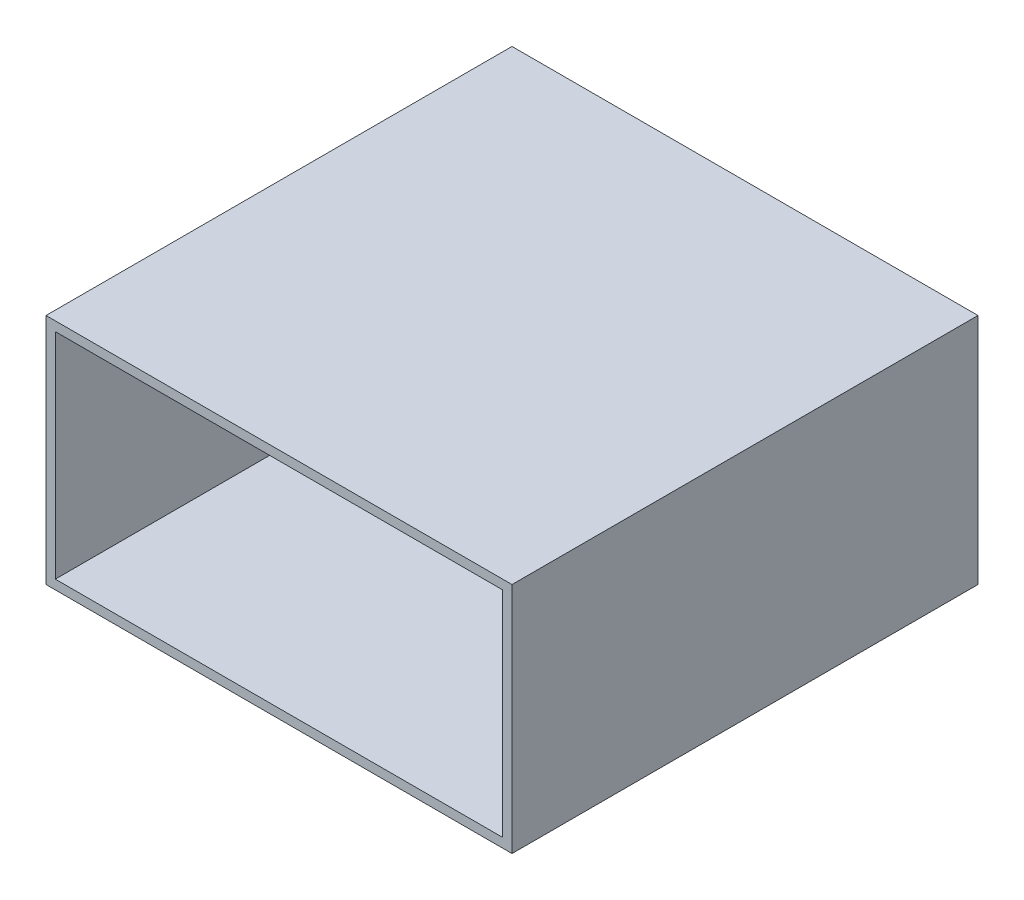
ISO-10303-21;
HEADER;
FILE_DESCRIPTION(('STEP AP214'),'2;1');
FILE_NAME('part.step','',(''),(''),'','','');
FILE_SCHEMA(('AUTOMOTIVE_DESIGN { 1 0 10303 214 1 1 1 1 }'));
ENDSEC;
DATA;
#1=APPLICATION_CONTEXT('core data for automotive mechanical design processes');
#2=APPLICATION_PROTOCOL_DEFINITION('international standard','automotive_design',2000,#1);
#3=PRODUCT_CONTEXT('',#1,'mechanical');
#4=PRODUCT('Part','Part','',(#3));
#5=PRODUCT_RELATED_PRODUCT_CATEGORY('part','',(#4));
#6=PRODUCT_DEFINITION_FORMATION('','',#4);
#7=PRODUCT_DEFINITION_CONTEXT('part definition',#1,'design');
#8=PRODUCT_DEFINITION('design','',#6,#7);
#9=PRODUCT_DEFINITION_SHAPE('','',#8);
#10=(LENGTH_UNIT() NAMED_UNIT(*) SI_UNIT(.MILLI.,.METRE.));
#11=(NAMED_UNIT(*) PLANE_ANGLE_UNIT() SI_UNIT($,.RADIAN.));
#12=(NAMED_UNIT(*) SI_UNIT($,.STERADIAN.) SOLID_ANGLE_UNIT());
#13=UNCERTAINTY_MEASURE_WITH_UNIT(LENGTH_MEASURE(1.E-05),#10,'distance_accuracy_value','');
#14=(GEOMETRIC_REPRESENTATION_CONTEXT(3) GLOBAL_UNCERTAINTY_ASSIGNED_CONTEXT((#13)) GLOBAL_UNIT_ASSIGNED_CONTEXT((#10,
#11,#12)) REPRESENTATION_CONTEXT('',''));
#15=CARTESIAN_POINT('',(0.,0.,0.));
#16=DIRECTION('',(0.,0.,1.));
#17=DIRECTION('',(1.,0.,0.));
#18=AXIS2_PLACEMENT_3D('',#15,#16,#17);
#19=CARTESIAN_POINT('',(-50.,50.,50.));
#20=DIRECTION('',(0.,0.,-1.));
#21=DIRECTION('',(-1.,0.,0.));
#22=AXIS2_PLACEMENT_3D('',#19,#20,#21);
#23=PLANE('',#22);
#24=DIRECTION('',(1.,0.,0.));
#25=VECTOR('',#24,1.);
#26=CARTESIAN_POINT('',(-50.,0.,50.));
#27=LINE('',#26,#25);
#28=CARTESIAN_POINT('',(-50.,0.,50.));
#29=VERTEX_POINT('',#28);
#30=CARTESIAN_POINT('',(50.,0.,50.));
#31=VERTEX_POINT('',#30);
#32=EDGE_CURVE('E77',#29,#31,#27,.T.);
#33=ORIENTED_EDGE('',*,*,#32,.T.);
#34=DIRECTION('',(0.,-1.,0.));
#35=VECTOR('',#34,1.);
#36=CARTESIAN_POINT('',(50.,50.,50.));
#37=LINE('',#36,#35);
#38=CARTESIAN_POINT('',(50.,50.,50.));
#39=VERTEX_POINT('',#38);
#40=EDGE_CURVE('E149',#39,#31,#37,.T.);
#41=ORIENTED_EDGE('',*,*,#40,.F.);
#42=DIRECTION('',(1.,0.,0.));
#43=VECTOR('',#42,1.);
#44=CARTESIAN_POINT('',(-50.,50.,50.));
#45=LINE('',#44,#43);
#46=CARTESIAN_POINT('',(-50.,50.,50.));
#47=VERTEX_POINT('',#46);
#48=EDGE_CURVE('E56',#47,#39,#45,.T.);
#49=ORIENTED_EDGE('',*,*,#48,.F.);
#50=DIRECTION('',(0.,-1.,0.));
#51=VECTOR('',#50,1.);
#52=CARTESIAN_POINT('',(-50.,50.,50.));
#53=LINE('',#52,#51);
#54=EDGE_CURVE('E159',#47,#29,#53,.T.);
#55=ORIENTED_EDGE('',*,*,#54,.T.);
#56=EDGE_LOOP('',(#33,#41,#49,#55));
#57=FACE_BOUND('',#56,.T.);
#58=DIRECTION('',(1.,0.,0.));
#59=VECTOR('',#58,1.);
#60=CARTESIAN_POINT('',(0.,2.,50.));
#61=LINE('',#60,#59);
#62=CARTESIAN_POINT('',(-48.,2.,50.));
#63=VERTEX_POINT('',#62);
#64=CARTESIAN_POINT('',(48.,2.,50.));
#65=VERTEX_POINT('',#64);
#66=EDGE_CURVE('E130',#63,#65,#61,.T.);
#67=ORIENTED_EDGE('',*,*,#66,.F.);
#68=DIRECTION('',(0.,-1.,0.));
#69=VECTOR('',#68,1.);
#70=CARTESIAN_POINT('',(-48.,50.,50.));
#71=LINE('',#70,#69);
#72=CARTESIAN_POINT('',(-48.,48.,50.));
#73=VERTEX_POINT('',#72);
#74=EDGE_CURVE('E125',#73,#63,#71,.T.);
#75=ORIENTED_EDGE('',*,*,#74,.F.);
#76=DIRECTION('',(1.,0.,0.));
#77=VECTOR('',#76,1.);
#78=CARTESIAN_POINT('',(0.,48.,50.));
#79=LINE('',#78,#77);
#80=CARTESIAN_POINT('',(48.,48.,50.));
#81=VERTEX_POINT('',#80);
#82=EDGE_CURVE('E47',#73,#81,#79,.T.);
#83=ORIENTED_EDGE('',*,*,#82,.T.);
#84=DIRECTION('',(0.,-1.,0.));
#85=VECTOR('',#84,1.);
#86=CARTESIAN_POINT('',(48.,50.,50.));
#87=LINE('',#86,#85);
#88=EDGE_CURVE('E138',#81,#65,#87,.T.);
#89=ORIENTED_EDGE('',*,*,#88,.T.);
#90=EDGE_LOOP('',(#67,#75,#83,#89));
#91=FACE_BOUND('',#90,.T.);
#92=ADVANCED_FACE('F32',(#57,#91),#23,.F.);
#93=CARTESIAN_POINT('',(50.,50.,50.));
#94=DIRECTION('',(-1.,0.,0.));
#95=DIRECTION('',(0.,0.,1.));
#96=AXIS2_PLACEMENT_3D('',#93,#94,#95);
#97=PLANE('',#96);
#98=DIRECTION('',(0.,0.,-1.));
#99=VECTOR('',#98,1.);
#100=CARTESIAN_POINT('',(50.,0.,50.));
#101=LINE('',#100,#99);
#102=CARTESIAN_POINT('',(50.,0.,-50.));
#103=VERTEX_POINT('',#102);
#104=EDGE_CURVE('E150',#31,#103,#101,.T.);
#105=ORIENTED_EDGE('',*,*,#104,.T.);
#106=DIRECTION('',(0.,-1.,0.));
#107=VECTOR('',#106,1.);
#108=CARTESIAN_POINT('',(50.,50.,-50.));
#109=LINE('',#108,#107);
#110=CARTESIAN_POINT('',(50.,50.,-50.));
#111=VERTEX_POINT('',#110);
#112=EDGE_CURVE('E11',#111,#103,#109,.T.);
#113=ORIENTED_EDGE('',*,*,#112,.F.);
#114=DIRECTION('',(0.,0.,-1.));
#115=VECTOR('',#114,1.);
#116=CARTESIAN_POINT('',(50.,50.,50.));
#117=LINE('',#116,#115);
#118=EDGE_CURVE('E143',#39,#111,#117,.T.);
#119=ORIENTED_EDGE('',*,*,#118,.F.);
#120=ORIENTED_EDGE('',*,*,#40,.T.);
#121=EDGE_LOOP('',(#105,#113,#119,#120));
#122=FACE_BOUND('',#121,.T.);
#123=ADVANCED_FACE('F34',(#122),#97,.F.);
#124=CARTESIAN_POINT('',(-50.,50.,-50.));
#125=DIRECTION('',(0.,0.,1.));
#126=DIRECTION('',(1.,0.,0.));
#127=AXIS2_PLACEMENT_3D('',#124,#125,#126);
#128=PLANE('',#127);
#129=DIRECTION('',(-1.,0.,0.));
#130=VECTOR('',#129,1.);
#131=CARTESIAN_POINT('',(-50.,0.,-50.));
#132=LINE('',#131,#130);
#133=CARTESIAN_POINT('',(-50.,0.,-50.));
#134=VERTEX_POINT('',#133);
#135=EDGE_CURVE('E153',#103,#134,#132,.T.);
#136=ORIENTED_EDGE('',*,*,#135,.T.);
#137=DIRECTION('',(0.,-1.,0.));
#138=VECTOR('',#137,1.);
#139=CARTESIAN_POINT('',(-50.,50.,-50.));
#140=LINE('',#139,#138);
#141=CARTESIAN_POINT('',(-50.,50.,-50.));
#142=VERTEX_POINT('',#141);
#143=EDGE_CURVE('E40',#142,#134,#140,.T.);
#144=ORIENTED_EDGE('',*,*,#143,.F.);
#145=DIRECTION('',(-1.,0.,0.));
#146=VECTOR('',#145,1.);
#147=CARTESIAN_POINT('',(-50.,50.,-50.));
#148=LINE('',#147,#146);
#149=EDGE_CURVE('E84',#111,#142,#148,.T.);
#150=ORIENTED_EDGE('',*,*,#149,.F.);
#151=ORIENTED_EDGE('',*,*,#112,.T.);
#152=EDGE_LOOP('',(#136,#144,#150,#151));
#153=FACE_BOUND('',#152,.T.);
#154=ADVANCED_FACE('F198',(#153),#128,.F.);
#155=CARTESIAN_POINT('',(-50.,50.,50.));
#156=DIRECTION('',(1.,0.,0.));
#157=DIRECTION('',(0.,0.,-1.));
#158=AXIS2_PLACEMENT_3D('',#155,#156,#157);
#159=PLANE('',#158);
#160=DIRECTION('',(0.,0.,1.));
#161=VECTOR('',#160,1.);
#162=CARTESIAN_POINT('',(-50.,0.,50.));
#163=LINE('',#162,#161);
#164=EDGE_CURVE('E155',#134,#29,#163,.T.);
#165=ORIENTED_EDGE('',*,*,#164,.T.);
#166=ORIENTED_EDGE('',*,*,#54,.F.);
#167=DIRECTION('',(0.,0.,1.));
#168=VECTOR('',#167,1.);
#169=CARTESIAN_POINT('',(-50.,50.,50.));
#170=LINE('',#169,#168);
#171=EDGE_CURVE('E146',#142,#47,#170,.T.);
#172=ORIENTED_EDGE('',*,*,#171,.F.);
#173=ORIENTED_EDGE('',*,*,#143,.T.);
#174=EDGE_LOOP('',(#165,#166,#172,#173));
#175=FACE_BOUND('',#174,.T.);
#176=ADVANCED_FACE('F164',(#175),#159,.F.);
#177=CARTESIAN_POINT('',(0.,50.,0.));
#178=DIRECTION('',(0.,-1.,0.));
#179=DIRECTION('',(0.,0.,-1.));
#180=AXIS2_PLACEMENT_3D('',#177,#178,#179);
#181=PLANE('',#180);
#182=ORIENTED_EDGE('',*,*,#118,.T.);
#183=ORIENTED_EDGE('',*,*,#149,.T.);
#184=ORIENTED_EDGE('',*,*,#171,.T.);
#185=ORIENTED_EDGE('',*,*,#48,.T.);
#186=EDGE_LOOP('',(#182,#183,#184,#185));
#187=FACE_BOUND('',#186,.T.);
#188=ADVANCED_FACE('F192',(#187),#181,.F.);
#189=CARTESIAN_POINT('',(0.,0.,0.));
#190=DIRECTION('',(0.,-1.,0.));
#191=DIRECTION('',(0.,0.,-1.));
#192=AXIS2_PLACEMENT_3D('',#189,#190,#191);
#193=PLANE('',#192);
#194=ORIENTED_EDGE('',*,*,#104,.F.);
#195=ORIENTED_EDGE('',*,*,#32,.F.);
#196=ORIENTED_EDGE('',*,*,#164,.F.);
#197=ORIENTED_EDGE('',*,*,#135,.F.);
#198=EDGE_LOOP('',(#194,#195,#196,#197));
#199=FACE_BOUND('',#198,.T.);
#200=ADVANCED_FACE('F168',(#199),#193,.T.);
#201=CARTESIAN_POINT('',(48.,50.,50.));
#202=DIRECTION('',(-1.,0.,0.));
#203=DIRECTION('',(0.,0.,1.));
#204=AXIS2_PLACEMENT_3D('',#201,#202,#203);
#205=PLANE('',#204);
#206=DIRECTION('',(0.,0.,-1.));
#207=VECTOR('',#206,1.);
#208=CARTESIAN_POINT('',(48.,2.,0.));
#209=LINE('',#208,#207);
#210=CARTESIAN_POINT('',(48.,2.,-48.));
#211=VERTEX_POINT('',#210);
#212=EDGE_CURVE('E114',#65,#211,#209,.T.);
#213=ORIENTED_EDGE('',*,*,#212,.F.);
#214=ORIENTED_EDGE('',*,*,#88,.F.);
#215=DIRECTION('',(0.,0.,-1.));
#216=VECTOR('',#215,1.);
#217=CARTESIAN_POINT('',(48.,48.,0.));
#218=LINE('',#217,#216);
#219=CARTESIAN_POINT('',(48.,48.,-48.));
#220=VERTEX_POINT('',#219);
#221=EDGE_CURVE('E132',#81,#220,#218,.T.);
#222=ORIENTED_EDGE('',*,*,#221,.T.);
#223=DIRECTION('',(0.,-1.,0.));
#224=VECTOR('',#223,1.);
#225=CARTESIAN_POINT('',(48.,50.,-48.));
#226=LINE('',#225,#224);
#227=EDGE_CURVE('E124',#220,#211,#226,.T.);
#228=ORIENTED_EDGE('',*,*,#227,.T.);
#229=EDGE_LOOP('',(#213,#214,#222,#228));
#230=FACE_BOUND('',#229,.T.);
#231=ADVANCED_FACE('F176',(#230),#205,.T.);
#232=CARTESIAN_POINT('',(-50.,50.,-48.));
#233=DIRECTION('',(0.,0.,1.));
#234=DIRECTION('',(1.,0.,0.));
#235=AXIS2_PLACEMENT_3D('',#232,#233,#234);
#236=PLANE('',#235);
#237=DIRECTION('',(-1.,0.,0.));
#238=VECTOR('',#237,1.);
#239=CARTESIAN_POINT('',(0.,2.,-48.));
#240=LINE('',#239,#238);
#241=CARTESIAN_POINT('',(-48.,2.,-48.));
#242=VERTEX_POINT('',#241);
#243=EDGE_CURVE('E107',#211,#242,#240,.T.);
#244=ORIENTED_EDGE('',*,*,#243,.F.);
#245=ORIENTED_EDGE('',*,*,#227,.F.);
#246=DIRECTION('',(-1.,0.,0.));
#247=VECTOR('',#246,1.);
#248=CARTESIAN_POINT('',(0.,48.,-48.));
#249=LINE('',#248,#247);
#250=CARTESIAN_POINT('',(-48.,48.,-48.));
#251=VERTEX_POINT('',#250);
#252=EDGE_CURVE('E122',#220,#251,#249,.T.);
#253=ORIENTED_EDGE('',*,*,#252,.T.);
#254=DIRECTION('',(0.,-1.,0.));
#255=VECTOR('',#254,1.);
#256=CARTESIAN_POINT('',(-48.,50.,-48.));
#257=LINE('',#256,#255);
#258=EDGE_CURVE('E120',#251,#242,#257,.T.);
#259=ORIENTED_EDGE('',*,*,#258,.T.);
#260=EDGE_LOOP('',(#244,#245,#253,#259));
#261=FACE_BOUND('',#260,.T.);
#262=ADVANCED_FACE('F121',(#261),#236,.T.);
#263=CARTESIAN_POINT('',(-48.,50.,50.));
#264=DIRECTION('',(1.,0.,0.));
#265=DIRECTION('',(0.,0.,-1.));
#266=AXIS2_PLACEMENT_3D('',#263,#264,#265);
#267=PLANE('',#266);
#268=DIRECTION('',(0.,0.,1.));
#269=VECTOR('',#268,1.);
#270=CARTESIAN_POINT('',(-48.,2.,0.));
#271=LINE('',#270,#269);
#272=EDGE_CURVE('E111',#242,#63,#271,.T.);
#273=ORIENTED_EDGE('',*,*,#272,.F.);
#274=ORIENTED_EDGE('',*,*,#258,.F.);
#275=DIRECTION('',(0.,0.,1.));
#276=VECTOR('',#275,1.);
#277=CARTESIAN_POINT('',(-48.,48.,0.));
#278=LINE('',#277,#276);
#279=EDGE_CURVE('E136',#251,#73,#278,.T.);
#280=ORIENTED_EDGE('',*,*,#279,.T.);
#281=ORIENTED_EDGE('',*,*,#74,.T.);
#282=EDGE_LOOP('',(#273,#274,#280,#281));
#283=FACE_BOUND('',#282,.T.);
#284=ADVANCED_FACE('F127',(#283),#267,.T.);
#285=CARTESIAN_POINT('',(0.,48.,0.));
#286=DIRECTION('',(0.,-1.,0.));
#287=DIRECTION('',(0.,0.,-1.));
#288=AXIS2_PLACEMENT_3D('',#285,#286,#287);
#289=PLANE('',#288);
#290=ORIENTED_EDGE('',*,*,#221,.F.);
#291=ORIENTED_EDGE('',*,*,#82,.F.);
#292=ORIENTED_EDGE('',*,*,#279,.F.);
#293=ORIENTED_EDGE('',*,*,#252,.F.);
#294=EDGE_LOOP('',(#290,#291,#292,#293));
#295=FACE_BOUND('',#294,.T.);
#296=ADVANCED_FACE('F181',(#295),#289,.T.);
#297=CARTESIAN_POINT('',(0.,2.,0.));
#298=DIRECTION('',(0.,-1.,0.));
#299=DIRECTION('',(0.,0.,-1.));
#300=AXIS2_PLACEMENT_3D('',#297,#298,#299);
#301=PLANE('',#300);
#302=ORIENTED_EDGE('',*,*,#212,.T.);
#303=ORIENTED_EDGE('',*,*,#243,.T.);
#304=ORIENTED_EDGE('',*,*,#272,.T.);
#305=ORIENTED_EDGE('',*,*,#66,.T.);
#306=EDGE_LOOP('',(#302,#303,#304,#305));
#307=FACE_BOUND('',#306,.T.);
#308=ADVANCED_FACE('F109',(#307),#301,.F.);
#309=CLOSED_SHELL('',(#92,#123,#154,#176,#188,#200,#231,#262,#284,#296,#308));
#310=MANIFOLD_SOLID_BREP('B2',#309);
#311=ADVANCED_BREP_SHAPE_REPRESENTATION('',(#18,#310),#14);
#312=SHAPE_DEFINITION_REPRESENTATION(#9,#311);
ENDSEC;
END-ISO-10303-21;
